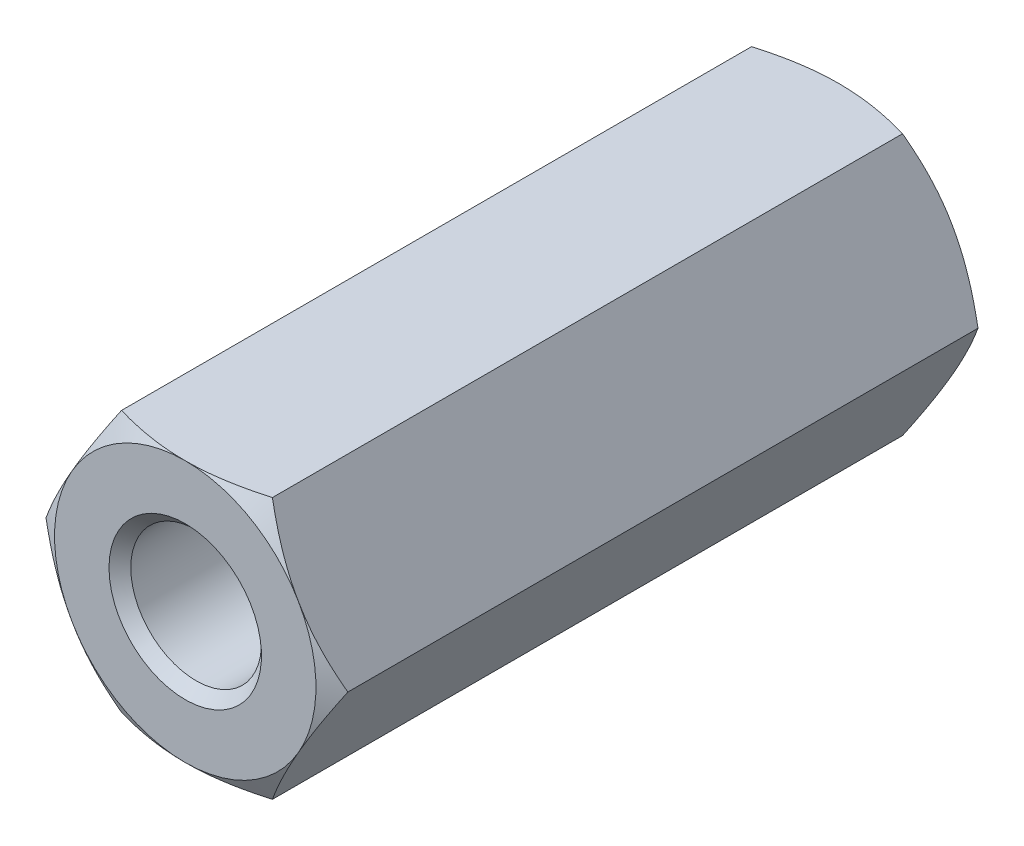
ISO-10303-21;
HEADER;
FILE_DESCRIPTION(('STEP AP214'),'2;1');
FILE_NAME('part.step','',(''),(''),'','','');
FILE_SCHEMA(('AUTOMOTIVE_DESIGN { 1 0 10303 214 1 1 1 1 }'));
ENDSEC;
DATA;
#1=APPLICATION_CONTEXT('core data for automotive mechanical design processes');
#2=APPLICATION_PROTOCOL_DEFINITION('international standard','automotive_design',2000,#1);
#3=PRODUCT_CONTEXT('',#1,'mechanical');
#4=PRODUCT('Part','Part','',(#3));
#5=PRODUCT_RELATED_PRODUCT_CATEGORY('part','',(#4));
#6=PRODUCT_DEFINITION_FORMATION('','',#4);
#7=PRODUCT_DEFINITION_CONTEXT('part definition',#1,'design');
#8=PRODUCT_DEFINITION('design','',#6,#7);
#9=PRODUCT_DEFINITION_SHAPE('','',#8);
#10=(LENGTH_UNIT() NAMED_UNIT(*) SI_UNIT(.MILLI.,.METRE.));
#11=(NAMED_UNIT(*) PLANE_ANGLE_UNIT() SI_UNIT($,.RADIAN.));
#12=(NAMED_UNIT(*) SI_UNIT($,.STERADIAN.) SOLID_ANGLE_UNIT());
#13=UNCERTAINTY_MEASURE_WITH_UNIT(LENGTH_MEASURE(1.E-05),#10,'distance_accuracy_value','');
#14=(GEOMETRIC_REPRESENTATION_CONTEXT(3) GLOBAL_UNCERTAINTY_ASSIGNED_CONTEXT((#13)) GLOBAL_UNIT_ASSIGNED_CONTEXT((#10,
#11,#12)) REPRESENTATION_CONTEXT('',''));
#15=CARTESIAN_POINT('',(0.,0.,0.));
#16=DIRECTION('',(0.,0.,1.));
#17=DIRECTION('',(1.,0.,0.));
#18=AXIS2_PLACEMENT_3D('',#15,#16,#17);
#19=CARTESIAN_POINT('',(3.46410161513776,0.,-7.5));
#20=DIRECTION('',(0.866025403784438,0.5,0.));
#21=DIRECTION('',(-0.5,0.866025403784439,0.));
#22=AXIS2_PLACEMENT_3D('',#19,#20,#21);
#23=PLANE('',#22);
#24=CARTESIAN_POINT('',(3.46421708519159,-0.000199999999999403,7.23198413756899));
#25=CARTESIAN_POINT('',(3.38810199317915,0.131635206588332,7.27594629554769));
#26=CARTESIAN_POINT('',(3.31132988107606,0.26460840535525,7.31592841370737));
#27=CARTESIAN_POINT('',(3.15645624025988,0.532857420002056,7.38571791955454));
#28=CARTESIAN_POINT('',(3.078351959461,0.668138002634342,7.41550061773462));
#29=CARTESIAN_POINT('',(2.92311136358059,0.937022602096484,7.46186216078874));
#30=CARTESIAN_POINT('',(2.84599893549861,1.07058524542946,7.47874955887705));
#31=CARTESIAN_POINT('',(2.6914112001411,1.33833905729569,7.49891035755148));
#32=CARTESIAN_POINT('',(2.61393645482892,1.47252925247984,7.50220045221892));
#33=CARTESIAN_POINT('',(2.46916798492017,1.72327559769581,7.49535946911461));
#34=CARTESIAN_POINT('',(2.40185259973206,1.83986926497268,7.48690808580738));
#35=CARTESIAN_POINT('',(2.2676603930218,2.07229698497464,7.46012105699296));
#36=CARTESIAN_POINT('',(2.2007840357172,2.18813023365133,7.44177625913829));
#37=CARTESIAN_POINT('',(2.06631510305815,2.42103725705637,7.39591524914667));
#38=CARTESIAN_POINT('',(1.99873954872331,2.53808155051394,7.36820461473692));
#39=CARTESIAN_POINT('',(1.86459637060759,2.77042435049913,7.3053122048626));
#40=CARTESIAN_POINT('',(1.79802702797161,2.88572583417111,7.27014520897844));
#41=CARTESIAN_POINT('',(1.73193533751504,3.0002,7.23198413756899));
#42=B_SPLINE_CURVE_WITH_KNOTS('',3,(#24,#25,#26,#27,#28,#29,#30,#31,#32,#33,#34,#35,#36,#37,#38,
#39,#40,#41),.UNSPECIFIED.,.F.,.F.,(4,2,2,2,2,2,2,2,4),(0.,0.475539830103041,0.952222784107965,
1.41710776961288,1.88142182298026,2.28572436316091,2.69040156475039,3.10405572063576,
3.5168974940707),.UNSPECIFIED.);
#43=CARTESIAN_POINT('',(3.46410161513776,0.,7.23205080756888));
#44=VERTEX_POINT('',#43);
#45=CARTESIAN_POINT('',(2.59807621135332,1.5,7.5));
#46=VERTEX_POINT('',#45);
#47=EDGE_CURVE('E127',#44,#46,#42,.T.);
#48=ORIENTED_EDGE('',*,*,#47,.F.);
#49=DIRECTION('',(0.,0.,1.));
#50=VECTOR('',#49,1.);
#51=CARTESIAN_POINT('',(3.46410161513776,0.,-7.5));
#52=LINE('',#51,#50);
#53=CARTESIAN_POINT('',(3.46410161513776,0.,-7.23205080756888));
#54=VERTEX_POINT('',#53);
#55=EDGE_CURVE('E564',#54,#44,#52,.T.);
#56=ORIENTED_EDGE('',*,*,#55,.F.);
#57=CARTESIAN_POINT('',(3.46421708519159,-0.000199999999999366,-7.23198413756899));
#58=CARTESIAN_POINT('',(3.38810199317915,0.131635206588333,-7.27594629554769));
#59=CARTESIAN_POINT('',(3.31132988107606,0.26460840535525,-7.31592841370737));
#60=CARTESIAN_POINT('',(3.15645624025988,0.532857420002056,-7.38571791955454));
#61=CARTESIAN_POINT('',(3.078351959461,0.668138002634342,-7.41550061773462));
#62=CARTESIAN_POINT('',(2.92311136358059,0.937022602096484,-7.46186216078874));
#63=CARTESIAN_POINT('',(2.84599893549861,1.07058524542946,-7.47874955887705));
#64=CARTESIAN_POINT('',(2.6914112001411,1.33833905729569,-7.49891035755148));
#65=CARTESIAN_POINT('',(2.61393645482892,1.47252925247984,-7.50220045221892));
#66=CARTESIAN_POINT('',(2.46916798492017,1.72327559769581,-7.49535946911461));
#67=CARTESIAN_POINT('',(2.40185259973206,1.83986926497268,-7.48690808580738));
#68=CARTESIAN_POINT('',(2.2676603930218,2.07229698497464,-7.46012105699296));
#69=CARTESIAN_POINT('',(2.2007840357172,2.18813023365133,-7.44177625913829));
#70=CARTESIAN_POINT('',(2.06631510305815,2.42103725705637,-7.39591524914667));
#71=CARTESIAN_POINT('',(1.99873954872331,2.53808155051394,-7.36820461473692));
#72=CARTESIAN_POINT('',(1.86459637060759,2.77042435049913,-7.3053122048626));
#73=CARTESIAN_POINT('',(1.79802702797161,2.88572583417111,-7.27014520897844));
#74=CARTESIAN_POINT('',(1.73193533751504,3.0002,-7.23198413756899));
#75=B_SPLINE_CURVE_WITH_KNOTS('',3,(#57,#58,#59,#60,#61,#62,#63,#64,#65,#66,#67,#68,#69,#70,#71,
#72,#73,#74),.UNSPECIFIED.,.F.,.F.,(4,2,2,2,2,2,2,2,4),(0.,0.475539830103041,0.952222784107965,
1.41710776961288,1.88142182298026,2.28572436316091,2.69040156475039,3.10405572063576,
3.5168974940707),.UNSPECIFIED.);
#76=CARTESIAN_POINT('',(2.59807621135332,1.5,-7.5));
#77=VERTEX_POINT('',#76);
#78=EDGE_CURVE('E534',#54,#77,#75,.T.);
#79=ORIENTED_EDGE('',*,*,#78,.T.);
#80=CARTESIAN_POINT('',(1.73205080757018,3.,-7.23205080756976));
#81=VERTEX_POINT('',#80);
#82=EDGE_CURVE('E269',#77,#81,#75,.T.);
#83=ORIENTED_EDGE('',*,*,#82,.T.);
#84=DIRECTION('',(0.,0.,1.));
#85=VECTOR('',#84,1.);
#86=CARTESIAN_POINT('',(1.73205080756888,3.,-7.5));
#87=LINE('',#86,#85);
#88=CARTESIAN_POINT('',(1.73205080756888,3.,7.23205080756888));
#89=VERTEX_POINT('',#88);
#90=EDGE_CURVE('E159',#81,#89,#87,.T.);
#91=ORIENTED_EDGE('',*,*,#90,.T.);
#92=EDGE_CURVE('E140',#46,#89,#42,.T.);
#93=ORIENTED_EDGE('',*,*,#92,.F.);
#94=EDGE_LOOP('',(#48,#56,#79,#83,#91,#93));
#95=FACE_BOUND('',#94,.T.);
#96=ADVANCED_FACE('F41',(#95),#23,.T.);
#97=CARTESIAN_POINT('',(1.73205080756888,-3.,-7.5));
#98=DIRECTION('',(0.866025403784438,-0.5,0.));
#99=DIRECTION('',(0.5,0.866025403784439,0.));
#100=AXIS2_PLACEMENT_3D('',#97,#98,#99);
#101=PLANE('',#100);
#102=CARTESIAN_POINT('',(1.73193533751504,-3.0002,7.23198413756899));
#103=CARTESIAN_POINT('',(1.80805042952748,-2.86836479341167,7.27594629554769));
#104=CARTESIAN_POINT('',(1.88482254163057,-2.73539159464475,7.31592841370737));
#105=CARTESIAN_POINT('',(2.03969618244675,-2.46714257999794,7.38571791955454));
#106=CARTESIAN_POINT('',(2.11780046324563,-2.33186199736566,7.41550061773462));
#107=CARTESIAN_POINT('',(2.27304105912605,-2.06297739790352,7.46186216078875));
#108=CARTESIAN_POINT('',(2.35015348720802,-1.92941475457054,7.47874955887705));
#109=CARTESIAN_POINT('',(2.50474122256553,-1.66166094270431,7.49891035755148));
#110=CARTESIAN_POINT('',(2.58221596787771,-1.52747074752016,7.50220045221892));
#111=CARTESIAN_POINT('',(2.72698443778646,-1.27672440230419,7.49535946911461));
#112=CARTESIAN_POINT('',(2.79429982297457,-1.16013073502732,7.48690808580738));
#113=CARTESIAN_POINT('',(2.92849202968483,-0.927703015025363,7.46012105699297));
#114=CARTESIAN_POINT('',(2.99536838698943,-0.811869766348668,7.44177625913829));
#115=CARTESIAN_POINT('',(3.12983731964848,-0.578962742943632,7.39591524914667));
#116=CARTESIAN_POINT('',(3.19741287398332,-0.461918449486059,7.36820461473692));
#117=CARTESIAN_POINT('',(3.33155605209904,-0.229575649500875,7.3053122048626));
#118=CARTESIAN_POINT('',(3.39812539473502,-0.114274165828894,7.27014520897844));
#119=CARTESIAN_POINT('',(3.46421708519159,0.000200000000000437,7.23198413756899));
#120=B_SPLINE_CURVE_WITH_KNOTS('',3,(#102,#103,#104,#105,#106,#107,#108,#109,#110,#111,#112,
#113,#114,#115,#116,#117,#118,#119),.UNSPECIFIED.,.F.,.F.,(4,2,2,2,2,2,2,2,4),(0.,
0.475539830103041,0.952222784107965,1.41710776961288,1.88142182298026,2.28572436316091,
2.69040156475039,3.10405572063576,3.5168974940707),.UNSPECIFIED.);
#121=CARTESIAN_POINT('',(1.73205080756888,-3.,7.23205080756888));
#122=VERTEX_POINT('',#121);
#123=CARTESIAN_POINT('',(2.59807621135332,-1.5,7.5));
#124=VERTEX_POINT('',#123);
#125=EDGE_CURVE('E539',#122,#124,#120,.T.);
#126=ORIENTED_EDGE('',*,*,#125,.F.);
#127=DIRECTION('',(0.,0.,1.));
#128=VECTOR('',#127,1.);
#129=CARTESIAN_POINT('',(1.73205080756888,-3.,-7.5));
#130=LINE('',#129,#128);
#131=CARTESIAN_POINT('',(1.73205080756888,-3.,-7.23205080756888));
#132=VERTEX_POINT('',#131);
#133=EDGE_CURVE('E283',#132,#122,#130,.T.);
#134=ORIENTED_EDGE('',*,*,#133,.F.);
#135=CARTESIAN_POINT('',(1.73193533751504,-3.0002,-7.23198413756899));
#136=CARTESIAN_POINT('',(1.80805042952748,-2.86836479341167,-7.27594629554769));
#137=CARTESIAN_POINT('',(1.88482254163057,-2.73539159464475,-7.31592841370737));
#138=CARTESIAN_POINT('',(2.03969618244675,-2.46714257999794,-7.38571791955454));
#139=CARTESIAN_POINT('',(2.11780046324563,-2.33186199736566,-7.41550061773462));
#140=CARTESIAN_POINT('',(2.27304105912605,-2.06297739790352,-7.46186216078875));
#141=CARTESIAN_POINT('',(2.35015348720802,-1.92941475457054,-7.47874955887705));
#142=CARTESIAN_POINT('',(2.50474122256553,-1.66166094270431,-7.49891035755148));
#143=CARTESIAN_POINT('',(2.58221596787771,-1.52747074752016,-7.50220045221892));
#144=CARTESIAN_POINT('',(2.72698443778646,-1.27672440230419,-7.49535946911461));
#145=CARTESIAN_POINT('',(2.79429982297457,-1.16013073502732,-7.48690808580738));
#146=CARTESIAN_POINT('',(2.92849202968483,-0.927703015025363,-7.46012105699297));
#147=CARTESIAN_POINT('',(2.99536838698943,-0.811869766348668,-7.44177625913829));
#148=CARTESIAN_POINT('',(3.12983731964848,-0.578962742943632,-7.39591524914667));
#149=CARTESIAN_POINT('',(3.19741287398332,-0.461918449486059,-7.36820461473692));
#150=CARTESIAN_POINT('',(3.33155605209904,-0.229575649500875,-7.3053122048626));
#151=CARTESIAN_POINT('',(3.39812539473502,-0.114274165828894,-7.27014520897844));
#152=CARTESIAN_POINT('',(3.46421708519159,0.000200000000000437,-7.23198413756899));
#153=B_SPLINE_CURVE_WITH_KNOTS('',3,(#135,#136,#137,#138,#139,#140,#141,#142,#143,#144,#145,
#146,#147,#148,#149,#150,#151,#152),.UNSPECIFIED.,.F.,.F.,(4,2,2,2,2,2,2,2,4),(0.,
0.475539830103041,0.952222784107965,1.41710776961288,1.88142182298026,2.28572436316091,
2.69040156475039,3.10405572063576,3.5168974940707),.UNSPECIFIED.);
#154=CARTESIAN_POINT('',(2.59807621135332,-1.5,-7.5));
#155=VERTEX_POINT('',#154);
#156=EDGE_CURVE('E545',#132,#155,#153,.T.);
#157=ORIENTED_EDGE('',*,*,#156,.T.);
#158=EDGE_CURVE('E284',#155,#54,#153,.T.);
#159=ORIENTED_EDGE('',*,*,#158,.T.);
#160=ORIENTED_EDGE('',*,*,#55,.T.);
#161=EDGE_CURVE('E132',#124,#44,#120,.T.);
#162=ORIENTED_EDGE('',*,*,#161,.F.);
#163=EDGE_LOOP('',(#126,#134,#157,#159,#160,#162));
#164=FACE_BOUND('',#163,.T.);
#165=ADVANCED_FACE('F254',(#164),#101,.T.);
#166=CARTESIAN_POINT('',(-1.73205080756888,-3.,-7.5));
#167=DIRECTION('',(0.,-1.,0.));
#168=DIRECTION('',(0.,0.,-1.));
#169=AXIS2_PLACEMENT_3D('',#166,#167,#168);
#170=PLANE('',#169);
#171=CARTESIAN_POINT('',(-13.3581553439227,-3.,1.32761504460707));
#172=CARTESIAN_POINT('',(-13.0674077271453,-3.,1.49139273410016));
#173=CARTESIAN_POINT('',(-12.7765550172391,-3.,1.65498426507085));
#174=CARTESIAN_POINT('',(-12.1945812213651,-3.,1.98169180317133));
#175=CARTESIAN_POINT('',(-11.9034601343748,-3.,2.14480780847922));
#176=CARTESIAN_POINT('',(-11.3208342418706,-3.,2.47049302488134));
#177=CARTESIAN_POINT('',(-11.0293293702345,-3.,2.63306211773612));
#178=CARTESIAN_POINT('',(-10.4459156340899,-3.,2.95747293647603));
#179=CARTESIAN_POINT('',(-10.1540067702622,-3.,3.11931466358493));
#180=CARTESIAN_POINT('',(-9.57133373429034,-3.,3.44115924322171));
#181=CARTESIAN_POINT('',(-9.28057244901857,-3.,3.60116731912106));
#182=CARTESIAN_POINT('',(-8.69840129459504,-3.,3.91999902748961));
#183=CARTESIAN_POINT('',(-8.40699142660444,-3.,4.0788226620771));
#184=CARTESIAN_POINT('',(-7.82335384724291,-3.,4.39488176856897));
#185=CARTESIAN_POINT('',(-7.53112623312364,-3.,4.55211741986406));
#186=CARTESIAN_POINT('',(-6.94553147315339,-3.,4.86445012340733));
#187=CARTESIAN_POINT('',(-6.65216433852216,-3.,5.01954719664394));
#188=CARTESIAN_POINT('',(-6.05641927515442,-3.,5.33061402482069));
#189=CARTESIAN_POINT('',(-5.75400103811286,-3.,5.48650672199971));
#190=CARTESIAN_POINT('',(-5.14673632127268,-3.,5.7936759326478));
#191=CARTESIAN_POINT('',(-4.84188938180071,-3.,5.94495154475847));
#192=CARTESIAN_POINT('',(-4.38096115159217,-3.,6.16688781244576));
#193=CARTESIAN_POINT('',(-4.22619248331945,-3.,6.24027062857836));
#194=CARTESIAN_POINT('',(-3.91555008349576,-3.,6.38465376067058));
#195=CARTESIAN_POINT('',(-3.75967638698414,-3.,6.45565415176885));
#196=CARTESIAN_POINT('',(-3.44659458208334,-3.,6.59456588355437));
#197=CARTESIAN_POINT('',(-3.28938678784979,-3.,6.66247792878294));
#198=CARTESIAN_POINT('',(-2.97329285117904,-3.,6.79425723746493));
#199=CARTESIAN_POINT('',(-2.81440685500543,-3.,6.85812485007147));
#200=CARTESIAN_POINT('',(-2.47241677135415,-3.,6.98897122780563));
#201=CARTESIAN_POINT('',(-2.28900492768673,-3.,7.05515675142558));
#202=CARTESIAN_POINT('',(-1.91889634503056,-3.,7.1778522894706));
#203=CARTESIAN_POINT('',(-1.73219914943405,-3.,7.23436094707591));
#204=CARTESIAN_POINT('',(-1.35757107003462,-3.,7.33330330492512));
#205=CARTESIAN_POINT('',(-1.16968774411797,-3.,7.3759103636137));
#206=CARTESIAN_POINT('',(-0.885576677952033,-3.,7.42686066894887));
#207=CARTESIAN_POINT('',(-0.790500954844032,-3.,7.44168327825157));
#208=CARTESIAN_POINT('',(-0.599732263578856,-3.,7.46654299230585));
#209=CARTESIAN_POINT('',(-0.504039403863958,-3.,7.47658091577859));
#210=CARTESIAN_POINT('',(-0.310465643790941,-3.,7.49164620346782));
#211=CARTESIAN_POINT('',(-0.212577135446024,-3.,7.49657696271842));
#212=CARTESIAN_POINT('',(-0.0166774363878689,-3.,7.50089527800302));
#213=CARTESIAN_POINT('',(0.0813337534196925,-3.,7.50028287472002));
#214=CARTESIAN_POINT('',(0.277172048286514,-3.,7.49353890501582));
#215=CARTESIAN_POINT('',(0.374999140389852,-3.,7.487406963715));
#216=CARTESIAN_POINT('',(0.570170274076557,-3.,7.46987533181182));
#217=CARTESIAN_POINT('',(0.667514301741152,-3.,7.45847549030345));
#218=CARTESIAN_POINT('',(0.960876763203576,-3.,7.41664053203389));
#219=CARTESIAN_POINT('',(1.15584956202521,-3.,7.37866756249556));
#220=CARTESIAN_POINT('',(1.44544526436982,-3.,7.31011549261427));
#221=CARTESIAN_POINT('',(1.54153346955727,-3.,7.28532185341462));
#222=CARTESIAN_POINT('',(1.73279599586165,-3.,7.23242137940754));
#223=CARTESIAN_POINT('',(1.8279703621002,-3.,7.20431470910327));
#224=CARTESIAN_POINT('',(2.08350367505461,-3.,7.12471346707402));
#225=CARTESIAN_POINT('',(2.24303639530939,-3.,7.07057745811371));
#226=CARTESIAN_POINT('',(2.55992784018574,-3.,6.95624024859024));
#227=CARTESIAN_POINT('',(2.71728599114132,-3.,6.89603748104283));
#228=CARTESIAN_POINT('',(3.03032027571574,-3.,6.77101720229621));
#229=CARTESIAN_POINT('',(3.18599466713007,-3.,6.70619535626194));
#230=CARTESIAN_POINT('',(3.49583273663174,-3.,6.57309454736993));
#231=CARTESIAN_POINT('',(3.64999655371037,-3.,6.50481590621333));
#232=CARTESIAN_POINT('',(3.95751153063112,-3.,6.36541468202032));
#233=CARTESIAN_POINT('',(4.11085953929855,-3.,6.29428517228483));
#234=CARTESIAN_POINT('',(4.41656841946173,-3.,6.14993195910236));
#235=CARTESIAN_POINT('',(4.5689292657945,-3.,6.07670820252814));
#236=CARTESIAN_POINT('',(5.02464616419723,-3.,5.85465847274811));
#237=CARTESIAN_POINT('',(5.32680431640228,-3.,5.70337673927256));
#238=CARTESIAN_POINT('',(5.93014146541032,-3.,5.39597031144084));
#239=CARTESIAN_POINT('',(6.23131182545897,-3.,5.23982878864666));
#240=CARTESIAN_POINT('',(6.83214794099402,-3.,4.92459449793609));
#241=CARTESIAN_POINT('',(7.13181350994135,-3.,4.76550137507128));
#242=CARTESIAN_POINT('',(7.72956256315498,-3.,4.44548367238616));
#243=CARTESIAN_POINT('',(8.02764778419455,-3.,4.28456232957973));
#244=CARTESIAN_POINT('',(8.62299007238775,-3.,3.96119400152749));
#245=CARTESIAN_POINT('',(8.92024713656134,-3.,3.79874701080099));
#246=CARTESIAN_POINT('',(9.56466312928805,-3.,3.4449615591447));
#247=CARTESIAN_POINT('',(9.91170551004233,-3.,3.25341096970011));
#248=CARTESIAN_POINT('',(10.6052826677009,-3.,2.86906995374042));
#249=CARTESIAN_POINT('',(10.9518171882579,-3.,2.67627906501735));
#250=CARTESIAN_POINT('',(11.6419356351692,-3.,2.29118510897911));
#251=CARTESIAN_POINT('',(11.9855230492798,-3.,2.09888828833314));
#252=CARTESIAN_POINT('',(12.6721730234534,-3.,1.71368353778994));
#253=CARTESIAN_POINT('',(13.0152357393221,-3.,1.52077588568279));
#254=CARTESIAN_POINT('',(13.3581553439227,-3.,1.32761504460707));
#255=B_SPLINE_CURVE_WITH_KNOTS('',3,(#171,#172,#173,#174,#175,#176,#177,#178,#179,#180,#181,
#182,#183,#184,#185,#186,#187,#188,#189,#190,#191,#192,#193,#194,#195,#196,#197,#198,#199,#200,
#201,#202,#203,#204,#205,#206,#207,#208,#209,#210,#211,#212,#213,#214,#215,#216,#217,#218,#219,
#220,#221,#222,#223,#224,#225,#226,#227,#228,#229,#230,#231,#232,#233,#234,#235,#236,#237,#238,
#239,#240,#241,#242,#243,#244,#245,#246,#247,#248,#249,#250,#251,#252,#253,#254),.UNSPECIFIED.,
.F.,.F.,(4,2,2,2,2,2,2,2,2,2,2,2,2,2,2,2,2,2,2,2,2,2,2,2,2,2,2,2,2,2,2,2,2,2,2,2,2,2,2,2,2,4),
(0.,1.00110750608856,2.00221884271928,3.00353425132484,4.00484797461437,5.00048761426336,
5.99612547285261,6.99164956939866,7.98716388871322,9.00784480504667,10.0287237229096,
10.5425621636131,11.0563843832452,11.5700887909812,12.0837487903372,12.6685158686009,
13.2533648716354,13.8306139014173,14.1191845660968,14.4077058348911,14.7015901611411,
14.9954723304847,15.289374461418,15.5832850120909,16.1782055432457,16.4758769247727,
16.773533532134,17.2787595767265,17.7841164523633,18.2899539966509,18.7957445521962,
19.3028489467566,19.8099662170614,20.8236468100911,21.8413478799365,22.8591721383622,
23.8754117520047,24.8916550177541,26.0808409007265,27.2704990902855,28.451715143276,
29.6324547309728),.UNSPECIFIED.);
#256=CARTESIAN_POINT('',(-1.73205080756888,-3.,7.23205080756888));
#257=VERTEX_POINT('',#256);
#258=CARTESIAN_POINT('',(0.,-3.,7.5));
#259=VERTEX_POINT('',#258);
#260=EDGE_CURVE('E537',#257,#259,#255,.T.);
#261=ORIENTED_EDGE('',*,*,#260,.F.);
#262=DIRECTION('',(0.,0.,1.));
#263=VECTOR('',#262,1.);
#264=CARTESIAN_POINT('',(-1.73205080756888,-3.,-7.5));
#265=LINE('',#264,#263);
#266=CARTESIAN_POINT('',(-1.73205080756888,-3.,-7.23205080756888));
#267=VERTEX_POINT('',#266);
#268=EDGE_CURVE('E558',#267,#257,#265,.T.);
#269=ORIENTED_EDGE('',*,*,#268,.F.);
#270=CARTESIAN_POINT('',(-8.64604011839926,-3.,-3.94830183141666));
#271=CARTESIAN_POINT('',(-8.45368531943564,-3.,-4.05321344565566));
#272=CARTESIAN_POINT('',(-8.26117828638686,-3.,-4.15784726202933));
#273=CARTESIAN_POINT('',(-7.87577965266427,-3.,-4.36641177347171));
#274=CARTESIAN_POINT('',(-7.68288804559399,-3.,-4.47034245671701));
#275=CARTESIAN_POINT('',(-7.29651600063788,-3.,-4.67741964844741));
#276=CARTESIAN_POINT('',(-7.10303525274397,-3.,-4.78056557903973));
#277=CARTESIAN_POINT('',(-6.7155110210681,-3.,-4.98579262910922));
#278=CARTESIAN_POINT('',(-6.52146754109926,-3.,-5.08787375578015));
#279=CARTESIAN_POINT('',(-6.12717231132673,-3.,-5.29356979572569));
#280=CARTESIAN_POINT('',(-5.92690044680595,-3.,-5.39714620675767));
#281=CARTESIAN_POINT('',(-5.52542127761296,-3.,-5.6024689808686));
#282=CARTESIAN_POINT('',(-5.32421398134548,-3.,-5.70421536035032));
#283=CARTESIAN_POINT('',(-4.92065250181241,-3.,-5.90527006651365));
#284=CARTESIAN_POINT('',(-4.71829865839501,-3.,-6.00457907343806));
#285=CARTESIAN_POINT('',(-4.31203204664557,-3.,-6.19994660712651));
#286=CARTESIAN_POINT('',(-4.10811934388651,-3.,-6.29600526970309));
#287=CARTESIAN_POINT('',(-3.69104144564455,-3.,-6.4869319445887));
#288=CARTESIAN_POINT('',(-3.47780257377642,-3.,-6.58164003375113));
#289=CARTESIAN_POINT('',(-3.04830169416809,-3.,-6.76419244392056));
#290=CARTESIAN_POINT('',(-2.83203885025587,-3.,-6.85203482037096));
#291=CARTESIAN_POINT('',(-2.39712563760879,-3.,-7.0169911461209));
#292=CARTESIAN_POINT('',(-2.17850236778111,-3.,-7.09417551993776));
#293=CARTESIAN_POINT('',(-1.73648860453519,-3.,-7.23361718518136));
#294=CARTESIAN_POINT('',(-1.51310048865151,-3.,-7.295881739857));
#295=CARTESIAN_POINT('',(-1.12382631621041,-3.,-7.38448212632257));
#296=CARTESIAN_POINT('',(-0.959139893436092,-3.,-7.41599244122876));
#297=CARTESIAN_POINT('',(-0.627685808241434,-3.,-7.46490689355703));
#298=CARTESIAN_POINT('',(-0.460919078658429,-3.,-7.48231713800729));
#299=CARTESIAN_POINT('',(-0.126992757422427,-3.,-7.50109298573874));
#300=CARTESIAN_POINT('',(0.0401638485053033,-3.,-7.50250998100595));
#301=CARTESIAN_POINT('',(0.373853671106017,-3.,-7.48925282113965));
#302=CARTESIAN_POINT('',(0.540386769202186,-3.,-7.47457574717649));
#303=CARTESIAN_POINT('',(0.824129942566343,-3.,-7.43706932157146));
#304=CARTESIAN_POINT('',(0.941831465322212,-3.,-7.41776959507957));
#305=CARTESIAN_POINT('',(1.17601843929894,-3.,-7.37276480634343));
#306=CARTESIAN_POINT('',(1.29250365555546,-3.,-7.34705852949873));
#307=CARTESIAN_POINT('',(1.52424748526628,-3.,-7.29020422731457));
#308=CARTESIAN_POINT('',(1.63950471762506,-3.,-7.25905064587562));
#309=CARTESIAN_POINT('',(1.86869640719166,-3.,-7.19225995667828));
#310=CARTESIAN_POINT('',(1.9826309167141,-3.,-7.15662302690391));
#311=CARTESIAN_POINT('',(2.21128623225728,-3.,-7.08101678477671));
#312=CARTESIAN_POINT('',(2.32598521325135,-3.,-7.04098190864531));
#313=CARTESIAN_POINT('',(2.55425959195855,-3.,-6.9578168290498));
#314=CARTESIAN_POINT('',(2.66783489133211,-3.,-6.91468635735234));
#315=CARTESIAN_POINT('',(3.00693599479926,-3.,-6.78160571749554));
#316=CARTESIAN_POINT('',(3.23099087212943,-3.,-6.68791365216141));
#317=CARTESIAN_POINT('',(3.68279803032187,-3.,-6.49097387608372));
#318=CARTESIAN_POINT('',(3.91046100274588,-3.,-6.38752439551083));
#319=CARTESIAN_POINT('',(4.36352762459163,-3.,-6.17576123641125));
#320=CARTESIAN_POINT('',(4.58893106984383,-3.,-6.06744712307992));
#321=CARTESIAN_POINT('',(5.03816268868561,-3.,-5.84733049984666));
#322=CARTESIAN_POINT('',(5.26198999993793,-3.,-5.73552623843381));
#323=CARTESIAN_POINT('',(5.70837689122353,-3.,-5.50941222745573));
#324=CARTESIAN_POINT('',(5.93093645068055,-3.,-5.39510243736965));
#325=CARTESIAN_POINT('',(6.36219153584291,-3.,-5.17129989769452));
#326=CARTESIAN_POINT('',(6.57094194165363,-3.,-5.06191268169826));
#327=CARTESIAN_POINT('',(6.98776257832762,-3.,-4.8418449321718));
#328=CARTESIAN_POINT('',(7.19583280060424,-3.,-4.7311643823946));
#329=CARTESIAN_POINT('',(7.61118044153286,-3.,-4.50891711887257));
#330=CARTESIAN_POINT('',(7.81845850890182,-3.,-4.39735161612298));
#331=CARTESIAN_POINT('',(8.23256258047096,-3.,-4.17339738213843));
#332=CARTESIAN_POINT('',(8.439388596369,-3.,-4.06100867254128));
#333=CARTESIAN_POINT('',(8.64604011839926,-3.,-3.94830183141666));
#334=B_SPLINE_CURVE_WITH_KNOTS('',3,(#270,#271,#272,#273,#274,#275,#276,#277,#278,#279,#280,
#281,#282,#283,#284,#285,#286,#287,#288,#289,#290,#291,#292,#293,#294,#295,#296,#297,#298,#299,
#300,#301,#302,#303,#304,#305,#306,#307,#308,#309,#310,#311,#312,#313,#314,#315,#316,#317,#318,
#319,#320,#321,#322,#323,#324,#325,#326,#327,#328,#329,#330,#331,#332,#333),.UNSPECIFIED.,.F.,
.F.,(4,2,2,2,2,2,2,2,2,2,2,2,2,2,2,2,2,2,2,2,2,2,2,2,2,2,2,2,2,2,2,4),(0.,0.657314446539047,
1.31463991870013,1.97240995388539,2.63017554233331,3.30657953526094,3.9829774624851,
4.65918441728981,5.33536308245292,6.03525738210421,6.73534919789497,7.43056764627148,
8.12544695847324,8.62797738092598,9.13029003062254,9.63098811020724,10.1317770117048,
10.4894145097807,10.8471198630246,11.2051922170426,11.5632503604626,11.9276514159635,
12.2920840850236,13.020462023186,13.7705849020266,14.5207749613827,15.2713477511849,
16.0219326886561,16.7289495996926,17.4359754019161,18.1421600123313,18.8483261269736),.UNSPECIFIED.);
#335=CARTESIAN_POINT('',(0.,-3.,-7.5));
#336=VERTEX_POINT('',#335);
#337=EDGE_CURVE('E566',#267,#336,#334,.T.);
#338=ORIENTED_EDGE('',*,*,#337,.T.);
#339=EDGE_CURVE('E259',#336,#132,#334,.T.);
#340=ORIENTED_EDGE('',*,*,#339,.T.);
#341=ORIENTED_EDGE('',*,*,#133,.T.);
#342=EDGE_CURVE('E138',#259,#122,#255,.T.);
#343=ORIENTED_EDGE('',*,*,#342,.F.);
#344=EDGE_LOOP('',(#261,#269,#338,#340,#341,#343));
#345=FACE_BOUND('',#344,.T.);
#346=ADVANCED_FACE('F292',(#345),#170,.T.);
#347=CARTESIAN_POINT('',(-3.46410161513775,0.,-7.5));
#348=DIRECTION('',(-0.866025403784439,-0.5,0.));
#349=DIRECTION('',(0.5,-0.866025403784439,0.));
#350=AXIS2_PLACEMENT_3D('',#347,#348,#349);
#351=PLANE('',#350);
#352=CARTESIAN_POINT('',(-3.46421708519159,0.000200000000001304,7.23198413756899));
#353=CARTESIAN_POINT('',(-3.38810199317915,-0.131635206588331,7.27594629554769));
#354=CARTESIAN_POINT('',(-3.31132988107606,-0.264608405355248,7.31592841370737));
#355=CARTESIAN_POINT('',(-3.15645624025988,-0.532857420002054,7.38571791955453));
#356=CARTESIAN_POINT('',(-3.078351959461,-0.66813800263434,7.41550061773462));
#357=CARTESIAN_POINT('',(-2.92311136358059,-0.937022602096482,7.46186216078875));
#358=CARTESIAN_POINT('',(-2.84599893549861,-1.07058524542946,7.47874955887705));
#359=CARTESIAN_POINT('',(-2.6914112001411,-1.33833905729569,7.49891035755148));
#360=CARTESIAN_POINT('',(-2.61393645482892,-1.47252925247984,7.50220045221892));
#361=CARTESIAN_POINT('',(-2.46916798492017,-1.72327559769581,7.49535946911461));
#362=CARTESIAN_POINT('',(-2.40185259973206,-1.83986926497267,7.48690808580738));
#363=CARTESIAN_POINT('',(-2.2676603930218,-2.07229698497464,7.46012105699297));
#364=CARTESIAN_POINT('',(-2.2007840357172,-2.18813023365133,7.44177625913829));
#365=CARTESIAN_POINT('',(-2.06631510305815,-2.42103725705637,7.39591524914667));
#366=CARTESIAN_POINT('',(-1.99873954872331,-2.53808155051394,7.36820461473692));
#367=CARTESIAN_POINT('',(-1.86459637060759,-2.77042435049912,7.3053122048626));
#368=CARTESIAN_POINT('',(-1.79802702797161,-2.88572583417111,7.27014520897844));
#369=CARTESIAN_POINT('',(-1.73193533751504,-3.0002,7.23198413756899));
#370=B_SPLINE_CURVE_WITH_KNOTS('',3,(#352,#353,#354,#355,#356,#357,#358,#359,#360,#361,#362,
#363,#364,#365,#366,#367,#368,#369),.UNSPECIFIED.,.F.,.F.,(4,2,2,2,2,2,2,2,4),(0.,
0.47553983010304,0.952222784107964,1.41710776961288,1.88142182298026,2.28572436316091,
2.69040156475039,3.10405572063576,3.5168974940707),.UNSPECIFIED.);
#371=CARTESIAN_POINT('',(-3.46410161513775,0.,7.23205080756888));
#372=VERTEX_POINT('',#371);
#373=CARTESIAN_POINT('',(-2.59807621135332,-1.5,7.5));
#374=VERTEX_POINT('',#373);
#375=EDGE_CURVE('E176',#372,#374,#370,.T.);
#376=ORIENTED_EDGE('',*,*,#375,.F.);
#377=DIRECTION('',(0.,0.,1.));
#378=VECTOR('',#377,1.);
#379=CARTESIAN_POINT('',(-3.46410161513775,0.,-7.5));
#380=LINE('',#379,#378);
#381=CARTESIAN_POINT('',(-3.46410161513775,0.,-7.23205080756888));
#382=VERTEX_POINT('',#381);
#383=EDGE_CURVE('E553',#382,#372,#380,.T.);
#384=ORIENTED_EDGE('',*,*,#383,.F.);
#385=CARTESIAN_POINT('',(-3.46421708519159,0.000200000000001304,-7.23198413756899));
#386=CARTESIAN_POINT('',(-3.38810199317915,-0.131635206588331,-7.27594629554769));
#387=CARTESIAN_POINT('',(-3.31132988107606,-0.264608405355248,-7.31592841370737));
#388=CARTESIAN_POINT('',(-3.15645624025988,-0.532857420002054,-7.38571791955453));
#389=CARTESIAN_POINT('',(-3.078351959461,-0.66813800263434,-7.41550061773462));
#390=CARTESIAN_POINT('',(-2.92311136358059,-0.937022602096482,-7.46186216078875));
#391=CARTESIAN_POINT('',(-2.84599893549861,-1.07058524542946,-7.47874955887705));
#392=CARTESIAN_POINT('',(-2.6914112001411,-1.33833905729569,-7.49891035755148));
#393=CARTESIAN_POINT('',(-2.61393645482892,-1.47252925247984,-7.50220045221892));
#394=CARTESIAN_POINT('',(-2.46916798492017,-1.72327559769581,-7.49535946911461));
#395=CARTESIAN_POINT('',(-2.40185259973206,-1.83986926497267,-7.48690808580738));
#396=CARTESIAN_POINT('',(-2.2676603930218,-2.07229698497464,-7.46012105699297));
#397=CARTESIAN_POINT('',(-2.2007840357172,-2.18813023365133,-7.44177625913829));
#398=CARTESIAN_POINT('',(-2.06631510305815,-2.42103725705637,-7.39591524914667));
#399=CARTESIAN_POINT('',(-1.99873954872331,-2.53808155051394,-7.36820461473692));
#400=CARTESIAN_POINT('',(-1.86459637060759,-2.77042435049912,-7.3053122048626));
#401=CARTESIAN_POINT('',(-1.79802702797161,-2.88572583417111,-7.27014520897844));
#402=CARTESIAN_POINT('',(-1.73193533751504,-3.0002,-7.23198413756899));
#403=B_SPLINE_CURVE_WITH_KNOTS('',3,(#385,#386,#387,#388,#389,#390,#391,#392,#393,#394,#395,
#396,#397,#398,#399,#400,#401,#402),.UNSPECIFIED.,.F.,.F.,(4,2,2,2,2,2,2,2,4),(0.,
0.47553983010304,0.952222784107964,1.41710776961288,1.88142182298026,2.28572436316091,
2.69040156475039,3.10405572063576,3.5168974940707),.UNSPECIFIED.);
#404=CARTESIAN_POINT('',(-2.59807621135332,-1.5,-7.5));
#405=VERTEX_POINT('',#404);
#406=EDGE_CURVE('E275',#382,#405,#403,.T.);
#407=ORIENTED_EDGE('',*,*,#406,.T.);
#408=EDGE_CURVE('E282',#405,#267,#403,.T.);
#409=ORIENTED_EDGE('',*,*,#408,.T.);
#410=ORIENTED_EDGE('',*,*,#268,.T.);
#411=EDGE_CURVE('E527',#374,#257,#370,.T.);
#412=ORIENTED_EDGE('',*,*,#411,.F.);
#413=EDGE_LOOP('',(#376,#384,#407,#409,#410,#412));
#414=FACE_BOUND('',#413,.T.);
#415=ADVANCED_FACE('F289',(#414),#351,.T.);
#416=CARTESIAN_POINT('',(-1.73205080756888,3.,-7.5));
#417=DIRECTION('',(-0.866025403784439,0.5,0.));
#418=DIRECTION('',(-0.5,-0.866025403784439,0.));
#419=AXIS2_PLACEMENT_3D('',#416,#417,#418);
#420=PLANE('',#419);
#421=CARTESIAN_POINT('',(-1.73193533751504,3.0002,7.23198413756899));
#422=CARTESIAN_POINT('',(-1.80805042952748,2.86836479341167,7.27594629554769));
#423=CARTESIAN_POINT('',(-1.88482254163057,2.73539159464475,7.31592841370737));
#424=CARTESIAN_POINT('',(-2.03969618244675,2.46714257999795,7.38571791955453));
#425=CARTESIAN_POINT('',(-2.11780046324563,2.33186199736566,7.41550061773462));
#426=CARTESIAN_POINT('',(-2.27304105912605,2.06297739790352,7.46186216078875));
#427=CARTESIAN_POINT('',(-2.35015348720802,1.92941475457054,7.47874955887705));
#428=CARTESIAN_POINT('',(-2.50474122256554,1.66166094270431,7.49891035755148));
#429=CARTESIAN_POINT('',(-2.58221596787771,1.52747074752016,7.50220045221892));
#430=CARTESIAN_POINT('',(-2.72698443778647,1.27672440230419,7.49535946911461));
#431=CARTESIAN_POINT('',(-2.79429982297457,1.16013073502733,7.48690808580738));
#432=CARTESIAN_POINT('',(-2.92849202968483,0.927703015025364,7.46012105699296));
#433=CARTESIAN_POINT('',(-2.99536838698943,0.81186976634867,7.44177625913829));
#434=CARTESIAN_POINT('',(-3.12983731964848,0.578962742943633,7.39591524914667));
#435=CARTESIAN_POINT('',(-3.19741287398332,0.46191844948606,7.36820461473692));
#436=CARTESIAN_POINT('',(-3.33155605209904,0.229575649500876,7.3053122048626));
#437=CARTESIAN_POINT('',(-3.39812539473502,0.114274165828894,7.27014520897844));
#438=CARTESIAN_POINT('',(-3.46421708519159,-0.000199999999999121,7.23198413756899));
#439=B_SPLINE_CURVE_WITH_KNOTS('',3,(#421,#422,#423,#424,#425,#426,#427,#428,#429,#430,#431,
#432,#433,#434,#435,#436,#437,#438),.UNSPECIFIED.,.F.,.F.,(4,2,2,2,2,2,2,2,4),(0.,
0.475539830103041,0.952222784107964,1.41710776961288,1.88142182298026,2.28572436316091,
2.69040156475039,3.10405572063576,3.5168974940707),.UNSPECIFIED.);
#440=CARTESIAN_POINT('',(-1.73205080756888,3.,7.23205080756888));
#441=VERTEX_POINT('',#440);
#442=CARTESIAN_POINT('',(-2.59807621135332,1.5,7.5));
#443=VERTEX_POINT('',#442);
#444=EDGE_CURVE('E183',#441,#443,#439,.T.);
#445=ORIENTED_EDGE('',*,*,#444,.F.);
#446=DIRECTION('',(0.,0.,1.));
#447=VECTOR('',#446,1.);
#448=CARTESIAN_POINT('',(-1.73205080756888,3.,-7.5));
#449=LINE('',#448,#447);
#450=CARTESIAN_POINT('',(-1.73205080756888,3.,-7.23205080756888));
#451=VERTEX_POINT('',#450);
#452=EDGE_CURVE('E233',#451,#441,#449,.T.);
#453=ORIENTED_EDGE('',*,*,#452,.F.);
#454=CARTESIAN_POINT('',(-1.73193533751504,3.0002,-7.23198413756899));
#455=CARTESIAN_POINT('',(-1.80805042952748,2.86836479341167,-7.27594629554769));
#456=CARTESIAN_POINT('',(-1.88482254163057,2.73539159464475,-7.31592841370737));
#457=CARTESIAN_POINT('',(-2.03969618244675,2.46714257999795,-7.38571791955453));
#458=CARTESIAN_POINT('',(-2.11780046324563,2.33186199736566,-7.41550061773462));
#459=CARTESIAN_POINT('',(-2.27304105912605,2.06297739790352,-7.46186216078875));
#460=CARTESIAN_POINT('',(-2.35015348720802,1.92941475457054,-7.47874955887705));
#461=CARTESIAN_POINT('',(-2.50474122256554,1.66166094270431,-7.49891035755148));
#462=CARTESIAN_POINT('',(-2.58221596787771,1.52747074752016,-7.50220045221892));
#463=CARTESIAN_POINT('',(-2.72698443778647,1.27672440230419,-7.49535946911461));
#464=CARTESIAN_POINT('',(-2.79429982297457,1.16013073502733,-7.48690808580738));
#465=CARTESIAN_POINT('',(-2.92849202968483,0.927703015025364,-7.46012105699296));
#466=CARTESIAN_POINT('',(-2.99536838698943,0.81186976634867,-7.44177625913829));
#467=CARTESIAN_POINT('',(-3.12983731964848,0.578962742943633,-7.39591524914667));
#468=CARTESIAN_POINT('',(-3.19741287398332,0.46191844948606,-7.36820461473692));
#469=CARTESIAN_POINT('',(-3.33155605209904,0.229575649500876,-7.3053122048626));
#470=CARTESIAN_POINT('',(-3.39812539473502,0.114274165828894,-7.27014520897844));
#471=CARTESIAN_POINT('',(-3.46421708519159,-0.000199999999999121,-7.23198413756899));
#472=B_SPLINE_CURVE_WITH_KNOTS('',3,(#454,#455,#456,#457,#458,#459,#460,#461,#462,#463,#464,
#465,#466,#467,#468,#469,#470,#471),.UNSPECIFIED.,.F.,.F.,(4,2,2,2,2,2,2,2,4),(0.,
0.475539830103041,0.952222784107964,1.41710776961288,1.88142182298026,2.28572436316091,
2.69040156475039,3.10405572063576,3.5168974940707),.UNSPECIFIED.);
#473=CARTESIAN_POINT('',(-2.59807621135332,1.5,-7.5));
#474=VERTEX_POINT('',#473);
#475=EDGE_CURVE('E237',#451,#474,#472,.T.);
#476=ORIENTED_EDGE('',*,*,#475,.T.);
#477=EDGE_CURVE('E557',#474,#382,#472,.T.);
#478=ORIENTED_EDGE('',*,*,#477,.T.);
#479=ORIENTED_EDGE('',*,*,#383,.T.);
#480=EDGE_CURVE('E603',#443,#372,#439,.T.);
#481=ORIENTED_EDGE('',*,*,#480,.F.);
#482=EDGE_LOOP('',(#445,#453,#476,#478,#479,#481));
#483=FACE_BOUND('',#482,.T.);
#484=ADVANCED_FACE('F218',(#483),#420,.T.);
#485=CARTESIAN_POINT('',(1.73205080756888,3.,-7.5));
#486=DIRECTION('',(0.,1.,0.));
#487=DIRECTION('',(-1.,0.,0.));
#488=AXIS2_PLACEMENT_3D('',#485,#486,#487);
#489=PLANE('',#488);
#490=CARTESIAN_POINT('',(13.3581553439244,3.,1.32761504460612));
#491=CARTESIAN_POINT('',(13.0674077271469,3.,1.49139273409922));
#492=CARTESIAN_POINT('',(12.7765550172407,3.,1.65498426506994));
#493=CARTESIAN_POINT('',(12.1945812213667,3.,1.98169180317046));
#494=CARTESIAN_POINT('',(11.9034601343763,3.,2.14480780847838));
#495=CARTESIAN_POINT('',(11.320834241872,3.,2.47049302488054));
#496=CARTESIAN_POINT('',(11.0293293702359,3.,2.63306211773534));
#497=CARTESIAN_POINT('',(10.4459156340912,3.,2.95747293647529));
#498=CARTESIAN_POINT('',(10.1540067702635,3.,3.11931466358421));
#499=CARTESIAN_POINT('',(9.57133373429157,3.,3.44115924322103));
#500=CARTESIAN_POINT('',(9.28057244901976,3.,3.60116731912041));
#501=CARTESIAN_POINT('',(8.69840129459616,3.,3.919999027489));
#502=CARTESIAN_POINT('',(8.40699142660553,3.,4.0788226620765));
#503=CARTESIAN_POINT('',(7.82335384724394,3.,4.39488176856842));
#504=CARTESIAN_POINT('',(7.53112623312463,3.,4.55211741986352));
#505=CARTESIAN_POINT('',(6.94553147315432,3.,4.86445012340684));
#506=CARTESIAN_POINT('',(6.65216433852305,3.,5.01954719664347));
#507=CARTESIAN_POINT('',(6.05641927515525,3.,5.33061402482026));
#508=CARTESIAN_POINT('',(5.75400103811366,3.,5.48650672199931));
#509=CARTESIAN_POINT('',(5.14673632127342,3.,5.79367593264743));
#510=CARTESIAN_POINT('',(4.84188938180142,3.,5.94495154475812));
#511=CARTESIAN_POINT('',(4.38096115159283,3.,6.16688781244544));
#512=CARTESIAN_POINT('',(4.22619248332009,3.,6.24027062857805));
#513=CARTESIAN_POINT('',(3.91555008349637,3.,6.3846537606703));
#514=CARTESIAN_POINT('',(3.75967638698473,3.,6.45565415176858));
#515=CARTESIAN_POINT('',(3.4465945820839,3.,6.59456588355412));
#516=CARTESIAN_POINT('',(3.28938678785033,3.,6.6624779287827));
#517=CARTESIAN_POINT('',(2.97329285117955,3.,6.79425723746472));
#518=CARTESIAN_POINT('',(2.81440685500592,3.,6.85812485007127));
#519=CARTESIAN_POINT('',(2.47241677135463,3.,6.98897122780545));
#520=CARTESIAN_POINT('',(2.28900492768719,3.,7.05515675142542));
#521=CARTESIAN_POINT('',(1.918896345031,3.,7.17785228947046));
#522=CARTESIAN_POINT('',(1.73219914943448,3.,7.23436094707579));
#523=CARTESIAN_POINT('',(1.35757107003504,3.,7.33330330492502));
#524=CARTESIAN_POINT('',(1.16968774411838,3.,7.37591036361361));
#525=CARTESIAN_POINT('',(0.885576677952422,3.,7.42686066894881));
#526=CARTESIAN_POINT('',(0.790500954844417,3.,7.44168327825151));
#527=CARTESIAN_POINT('',(0.59973226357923,3.,7.46654299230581));
#528=CARTESIAN_POINT('',(0.504039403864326,3.,7.47658091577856));
#529=CARTESIAN_POINT('',(0.310465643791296,3.,7.4916462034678));
#530=CARTESIAN_POINT('',(0.212577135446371,3.,7.4965769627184));
#531=CARTESIAN_POINT('',(0.0166774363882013,3.,7.50089527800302));
#532=CARTESIAN_POINT('',(-0.0813337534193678,3.,7.50028287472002));
#533=CARTESIAN_POINT('',(-0.277172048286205,3.,7.49353890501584));
#534=CARTESIAN_POINT('',(-0.374999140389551,3.,7.48740696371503));
#535=CARTESIAN_POINT('',(-0.570170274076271,3.,7.46987533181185));
#536=CARTESIAN_POINT('',(-0.667514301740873,3.,7.45847549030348));
#537=CARTESIAN_POINT('',(-0.96087676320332,3.,7.41664053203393));
#538=CARTESIAN_POINT('',(-1.15584956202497,3.,7.3786675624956));
#539=CARTESIAN_POINT('',(-1.44544526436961,3.,7.31011549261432));
#540=CARTESIAN_POINT('',(-1.54153346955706,3.,7.28532185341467));
#541=CARTESIAN_POINT('',(-1.73279599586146,3.,7.2324213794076));
#542=CARTESIAN_POINT('',(-1.82797036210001,3.,7.20431470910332));
#543=CARTESIAN_POINT('',(-2.08350367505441,3.,7.12471346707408));
#544=CARTESIAN_POINT('',(-2.24303639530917,3.,7.07057745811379));
#545=CARTESIAN_POINT('',(-2.55992784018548,3.,6.95624024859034));
#546=CARTESIAN_POINT('',(-2.71728599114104,3.,6.89603748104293));
#547=CARTESIAN_POINT('',(-3.03032027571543,3.,6.77101720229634));
#548=CARTESIAN_POINT('',(-3.18599466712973,3.,6.70619535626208));
#549=CARTESIAN_POINT('',(-3.49583273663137,3.,6.57309454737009));
#550=CARTESIAN_POINT('',(-3.64999655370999,3.,6.5048159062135));
#551=CARTESIAN_POINT('',(-3.9575115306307,3.,6.36541468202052));
#552=CARTESIAN_POINT('',(-4.1108595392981,3.,6.29428517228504));
#553=CARTESIAN_POINT('',(-4.41656841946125,3.,6.14993195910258));
#554=CARTESIAN_POINT('',(-4.56892926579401,3.,6.07670820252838));
#555=CARTESIAN_POINT('',(-5.02464616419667,3.,5.85465847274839));
#556=CARTESIAN_POINT('',(-5.32680431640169,3.,5.70337673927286));
#557=CARTESIAN_POINT('',(-5.93014146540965,3.,5.39597031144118));
#558=CARTESIAN_POINT('',(-6.23131182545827,3.,5.23982878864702));
#559=CARTESIAN_POINT('',(-6.83214794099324,3.,4.9245944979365));
#560=CARTESIAN_POINT('',(-7.13181350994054,3.,4.76550137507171));
#561=CARTESIAN_POINT('',(-7.72956256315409,3.,4.44548367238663));
#562=CARTESIAN_POINT('',(-8.02764778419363,3.,4.28456232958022));
#563=CARTESIAN_POINT('',(-8.62299007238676,3.,3.96119400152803));
#564=CARTESIAN_POINT('',(-8.92024713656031,3.,3.79874701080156));
#565=CARTESIAN_POINT('',(-9.56466312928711,3.,3.44496155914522));
#566=CARTESIAN_POINT('',(-9.91170551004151,3.,3.25341096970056));
#567=CARTESIAN_POINT('',(-10.6052826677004,3.,2.86906995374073));
#568=CARTESIAN_POINT('',(-10.9518171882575,3.,2.6762790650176));
#569=CARTESIAN_POINT('',(-11.641935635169,3.,2.29118510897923));
#570=CARTESIAN_POINT('',(-11.9855230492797,3.,2.09888828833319));
#571=CARTESIAN_POINT('',(-12.6721730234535,3.,1.71368353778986));
#572=CARTESIAN_POINT('',(-13.0152357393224,3.,1.52077588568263));
#573=CARTESIAN_POINT('',(-13.3581553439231,3.,1.32761504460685));
#574=B_SPLINE_CURVE_WITH_KNOTS('',3,(#490,#491,#492,#493,#494,#495,#496,#497,#498,#499,#500,
#501,#502,#503,#504,#505,#506,#507,#508,#509,#510,#511,#512,#513,#514,#515,#516,#517,#518,#519,
#520,#521,#522,#523,#524,#525,#526,#527,#528,#529,#530,#531,#532,#533,#534,#535,#536,#537,#538,
#539,#540,#541,#542,#543,#544,#545,#546,#547,#548,#549,#550,#551,#552,#553,#554,#555,#556,#557,
#558,#559,#560,#561,#562,#563,#564,#565,#566,#567,#568,#569,#570,#571,#572,#573),.UNSPECIFIED.,
.F.,.F.,(4,2,2,2,2,2,2,2,2,2,2,2,2,2,2,2,2,2,2,2,2,2,2,2,2,2,2,2,2,2,2,2,2,2,2,2,2,2,2,2,2,4),
(0.,1.00110750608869,2.00221884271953,3.00353425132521,4.00484797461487,5.00048761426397,
5.99612547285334,6.99164956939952,7.98716388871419,9.00784480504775,10.0287237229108,
10.5425621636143,11.0563843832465,11.5700887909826,12.0837487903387,12.6685158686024,
13.2533648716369,13.8306139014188,14.1191845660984,14.4077058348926,14.7015901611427,
14.9954723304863,15.2893744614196,15.5832850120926,16.1782055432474,16.4758769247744,
16.7735335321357,17.2787595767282,17.7841164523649,18.2899539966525,18.7957445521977,
19.302848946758,19.8099662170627,20.8236468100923,21.8413478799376,22.8591721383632,
23.8754117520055,24.8916550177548,26.0808409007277,27.270499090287,28.451715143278,
29.6324547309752),.UNSPECIFIED.);
#575=CARTESIAN_POINT('',(0.,3.,7.5));
#576=VERTEX_POINT('',#575);
#577=EDGE_CURVE('E145',#89,#576,#574,.T.);
#578=ORIENTED_EDGE('',*,*,#577,.F.);
#579=ORIENTED_EDGE('',*,*,#90,.F.);
#580=CARTESIAN_POINT('',(8.64604011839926,3.,-3.94830183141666));
#581=CARTESIAN_POINT('',(8.45368531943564,3.,-4.05321344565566));
#582=CARTESIAN_POINT('',(8.26117828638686,3.,-4.15784726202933));
#583=CARTESIAN_POINT('',(7.87577965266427,3.,-4.36641177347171));
#584=CARTESIAN_POINT('',(7.68288804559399,3.,-4.470342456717));
#585=CARTESIAN_POINT('',(7.29651600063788,3.,-4.67741964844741));
#586=CARTESIAN_POINT('',(7.10303525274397,3.,-4.78056557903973));
#587=CARTESIAN_POINT('',(6.7155110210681,3.,-4.98579262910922));
#588=CARTESIAN_POINT('',(6.52146754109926,3.,-5.08787375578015));
#589=CARTESIAN_POINT('',(6.12717231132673,3.,-5.29356979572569));
#590=CARTESIAN_POINT('',(5.92690044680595,3.,-5.39714620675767));
#591=CARTESIAN_POINT('',(5.52542127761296,3.,-5.6024689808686));
#592=CARTESIAN_POINT('',(5.32421398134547,3.,-5.70421536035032));
#593=CARTESIAN_POINT('',(4.92065250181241,3.,-5.90527006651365));
#594=CARTESIAN_POINT('',(4.71829865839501,3.,-6.00457907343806));
#595=CARTESIAN_POINT('',(4.31203204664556,3.,-6.19994660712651));
#596=CARTESIAN_POINT('',(4.10811934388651,3.,-6.29600526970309));
#597=CARTESIAN_POINT('',(3.69104144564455,3.,-6.4869319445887));
#598=CARTESIAN_POINT('',(3.47780257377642,3.,-6.58164003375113));
#599=CARTESIAN_POINT('',(3.04830169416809,3.,-6.76419244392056));
#600=CARTESIAN_POINT('',(2.83203885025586,3.,-6.85203482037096));
#601=CARTESIAN_POINT('',(2.39712563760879,3.,-7.0169911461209));
#602=CARTESIAN_POINT('',(2.1785023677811,3.,-7.09417551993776));
#603=CARTESIAN_POINT('',(1.73648860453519,3.,-7.23361718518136));
#604=CARTESIAN_POINT('',(1.51310048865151,3.,-7.295881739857));
#605=CARTESIAN_POINT('',(1.12382631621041,3.,-7.38448212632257));
#606=CARTESIAN_POINT('',(0.959139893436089,3.,-7.41599244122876));
#607=CARTESIAN_POINT('',(0.627685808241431,3.,-7.46490689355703));
#608=CARTESIAN_POINT('',(0.460919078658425,3.,-7.48231713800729));
#609=CARTESIAN_POINT('',(0.126992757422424,3.,-7.50109298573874));
#610=CARTESIAN_POINT('',(-0.0401638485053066,3.,-7.50250998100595));
#611=CARTESIAN_POINT('',(-0.37385367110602,3.,-7.48925282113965));
#612=CARTESIAN_POINT('',(-0.54038676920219,3.,-7.47457574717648));
#613=CARTESIAN_POINT('',(-0.824129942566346,3.,-7.43706932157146));
#614=CARTESIAN_POINT('',(-0.941831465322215,3.,-7.41776959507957));
#615=CARTESIAN_POINT('',(-1.17601843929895,3.,-7.37276480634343));
#616=CARTESIAN_POINT('',(-1.29250365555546,3.,-7.34705852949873));
#617=CARTESIAN_POINT('',(-1.52424748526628,3.,-7.29020422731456));
#618=CARTESIAN_POINT('',(-1.63950471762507,3.,-7.25905064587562));
#619=CARTESIAN_POINT('',(-1.86869640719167,3.,-7.19225995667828));
#620=CARTESIAN_POINT('',(-1.98263091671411,3.,-7.15662302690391));
#621=CARTESIAN_POINT('',(-2.21128623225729,3.,-7.08101678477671));
#622=CARTESIAN_POINT('',(-2.32598521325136,3.,-7.04098190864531));
#623=CARTESIAN_POINT('',(-2.55425959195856,3.,-6.95781682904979));
#624=CARTESIAN_POINT('',(-2.66783489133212,3.,-6.91468635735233));
#625=CARTESIAN_POINT('',(-3.00693599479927,3.,-6.78160571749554));
#626=CARTESIAN_POINT('',(-3.23099087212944,3.,-6.6879136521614));
#627=CARTESIAN_POINT('',(-3.68279803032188,3.,-6.49097387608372));
#628=CARTESIAN_POINT('',(-3.91046100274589,3.,-6.38752439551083));
#629=CARTESIAN_POINT('',(-4.36352762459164,3.,-6.17576123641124));
#630=CARTESIAN_POINT('',(-4.58893106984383,3.,-6.06744712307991));
#631=CARTESIAN_POINT('',(-5.03816268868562,3.,-5.84733049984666));
#632=CARTESIAN_POINT('',(-5.26198999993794,3.,-5.73552623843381));
#633=CARTESIAN_POINT('',(-5.70837689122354,3.,-5.50941222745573));
#634=CARTESIAN_POINT('',(-5.93093645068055,3.,-5.39510243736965));
#635=CARTESIAN_POINT('',(-6.36219153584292,3.,-5.17129989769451));
#636=CARTESIAN_POINT('',(-6.57094194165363,3.,-5.06191268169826));
#637=CARTESIAN_POINT('',(-6.98776257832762,3.,-4.8418449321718));
#638=CARTESIAN_POINT('',(-7.19583280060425,3.,-4.7311643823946));
#639=CARTESIAN_POINT('',(-7.61118044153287,3.,-4.50891711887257));
#640=CARTESIAN_POINT('',(-7.81845850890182,3.,-4.39735161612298));
#641=CARTESIAN_POINT('',(-8.23256258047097,3.,-4.17339738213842));
#642=CARTESIAN_POINT('',(-8.439388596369,3.,-4.06100867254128));
#643=CARTESIAN_POINT('',(-8.64604011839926,3.,-3.94830183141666));
#644=B_SPLINE_CURVE_WITH_KNOTS('',3,(#580,#581,#582,#583,#584,#585,#586,#587,#588,#589,#590,
#591,#592,#593,#594,#595,#596,#597,#598,#599,#600,#601,#602,#603,#604,#605,#606,#607,#608,#609,
#610,#611,#612,#613,#614,#615,#616,#617,#618,#619,#620,#621,#622,#623,#624,#625,#626,#627,#628,
#629,#630,#631,#632,#633,#634,#635,#636,#637,#638,#639,#640,#641,#642,#643),.UNSPECIFIED.,.F.,
.F.,(4,2,2,2,2,2,2,2,2,2,2,2,2,2,2,2,2,2,2,2,2,2,2,2,2,2,2,2,2,2,2,4),(0.,0.657314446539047,
1.31463991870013,1.97240995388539,2.63017554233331,3.30657953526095,3.98297746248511,
4.65918441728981,5.33536308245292,6.03525738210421,6.73534919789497,7.43056764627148,
8.12544695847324,8.62797738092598,9.13029003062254,9.63098811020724,10.1317770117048,
10.4894145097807,10.8471198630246,11.2051922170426,11.5632503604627,11.9276514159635,
12.2920840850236,13.020462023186,13.7705849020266,14.5207749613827,15.2713477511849,
16.0219326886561,16.7289495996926,17.4359754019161,18.1421600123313,18.8483261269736),.UNSPECIFIED.);
#645=CARTESIAN_POINT('',(0.,3.,-7.5));
#646=VERTEX_POINT('',#645);
#647=EDGE_CURVE('E234',#81,#646,#644,.T.);
#648=ORIENTED_EDGE('',*,*,#647,.T.);
#649=EDGE_CURVE('E223',#646,#451,#644,.T.);
#650=ORIENTED_EDGE('',*,*,#649,.T.);
#651=ORIENTED_EDGE('',*,*,#452,.T.);
#652=EDGE_CURVE('E161',#576,#441,#574,.T.);
#653=ORIENTED_EDGE('',*,*,#652,.F.);
#654=EDGE_LOOP('',(#578,#579,#648,#650,#651,#653));
#655=FACE_BOUND('',#654,.T.);
#656=ADVANCED_FACE('F214',(#655),#489,.T.);
#657=CARTESIAN_POINT('',(0.,0.,-7.5));
#658=DIRECTION('',(0.,0.,1.));
#659=DIRECTION('',(-1.,0.,0.));
#660=AXIS2_PLACEMENT_3D('',#657,#658,#659);
#661=CONICAL_SURFACE('',#660,3.,1.0471975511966);
#662=CARTESIAN_POINT('',(0.,0.,-7.5));
#663=DIRECTION('',(0.,0.,1.));
#664=DIRECTION('',(1.,0.,0.));
#665=AXIS2_PLACEMENT_3D('',#662,#663,#664);
#666=CIRCLE('',#665,3.);
#667=EDGE_CURVE('E540',#155,#77,#666,.T.);
#668=ORIENTED_EDGE('',*,*,#667,.T.);
#669=ORIENTED_EDGE('',*,*,#78,.F.);
#670=ORIENTED_EDGE('',*,*,#158,.F.);
#671=EDGE_LOOP('',(#668,#669,#670));
#672=FACE_BOUND('',#671,.T.);
#673=ADVANCED_FACE('F217',(#672),#661,.T.);
#674=EDGE_CURVE('E533',#336,#155,#666,.T.);
#675=ORIENTED_EDGE('',*,*,#674,.T.);
#676=ORIENTED_EDGE('',*,*,#156,.F.);
#677=ORIENTED_EDGE('',*,*,#339,.F.);
#678=EDGE_LOOP('',(#675,#676,#677));
#679=FACE_BOUND('',#678,.T.);
#680=ADVANCED_FACE('F337',(#679),#661,.T.);
#681=ORIENTED_EDGE('',*,*,#408,.F.);
#682=EDGE_CURVE('E529',#405,#336,#666,.T.);
#683=ORIENTED_EDGE('',*,*,#682,.T.);
#684=ORIENTED_EDGE('',*,*,#337,.F.);
#685=EDGE_LOOP('',(#681,#683,#684));
#686=FACE_BOUND('',#685,.T.);
#687=ADVANCED_FACE('F251',(#686),#661,.T.);
#688=ORIENTED_EDGE('',*,*,#477,.F.);
#689=EDGE_CURVE('E532',#474,#405,#666,.T.);
#690=ORIENTED_EDGE('',*,*,#689,.T.);
#691=ORIENTED_EDGE('',*,*,#406,.F.);
#692=EDGE_LOOP('',(#688,#690,#691));
#693=FACE_BOUND('',#692,.T.);
#694=ADVANCED_FACE('F249',(#693),#661,.T.);
#695=ORIENTED_EDGE('',*,*,#649,.F.);
#696=CARTESIAN_POINT('',(0.,0.,-7.5));
#697=DIRECTION('',(0.,0.,-1.));
#698=DIRECTION('',(-1.,0.,0.));
#699=AXIS2_PLACEMENT_3D('',#696,#697,#698);
#700=CIRCLE('',#699,3.);
#701=EDGE_CURVE('E235',#474,#646,#700,.T.);
#702=ORIENTED_EDGE('',*,*,#701,.F.);
#703=ORIENTED_EDGE('',*,*,#475,.F.);
#704=EDGE_LOOP('',(#695,#702,#703));
#705=FACE_BOUND('',#704,.T.);
#706=ADVANCED_FACE('F243',(#705),#661,.T.);
#707=EDGE_CURVE('E542',#77,#646,#666,.T.);
#708=ORIENTED_EDGE('',*,*,#707,.T.);
#709=ORIENTED_EDGE('',*,*,#647,.F.);
#710=ORIENTED_EDGE('',*,*,#82,.F.);
#711=EDGE_LOOP('',(#708,#709,#710));
#712=FACE_BOUND('',#711,.T.);
#713=ADVANCED_FACE('F248',(#712),#661,.T.);
#714=CARTESIAN_POINT('',(0.,0.,-7.5));
#715=DIRECTION('',(0.,0.,1.));
#716=DIRECTION('',(1.,0.,0.));
#717=AXIS2_PLACEMENT_3D('',#714,#715,#716);
#718=PLANE('',#717);
#719=CARTESIAN_POINT('',(0.,0.,-7.5));
#720=DIRECTION('',(0.,0.,1.));
#721=DIRECTION('',(1.,0.,0.));
#722=AXIS2_PLACEMENT_3D('',#719,#720,#721);
#723=CIRCLE('',#722,1.75);
#724=CARTESIAN_POINT('',(1.75,0.,-7.5));
#725=VERTEX_POINT('',#724);
#726=EDGE_CURVE('E586',#725,#725,#723,.T.);
#727=ORIENTED_EDGE('',*,*,#726,.T.);
#728=EDGE_LOOP('',(#727));
#729=FACE_BOUND('',#728,.T.);
#730=ORIENTED_EDGE('',*,*,#707,.F.);
#731=ORIENTED_EDGE('',*,*,#667,.F.);
#732=ORIENTED_EDGE('',*,*,#674,.F.);
#733=ORIENTED_EDGE('',*,*,#682,.F.);
#734=ORIENTED_EDGE('',*,*,#689,.F.);
#735=ORIENTED_EDGE('',*,*,#701,.T.);
#736=EDGE_LOOP('',(#730,#731,#732,#733,#734,#735));
#737=FACE_BOUND('',#736,.T.);
#738=ADVANCED_FACE('F371',(#729,#737),#718,.F.);
#739=CARTESIAN_POINT('',(0.,0.,0.));
#740=DIRECTION('',(0.,0.,-1.));
#741=DIRECTION('',(-1.,0.,0.));
#742=AXIS2_PLACEMENT_3D('',#739,#740,#741);
#743=CYLINDRICAL_SURFACE('',#742,1.5);
#744=CARTESIAN_POINT('',(0.,0.,7.25));
#745=DIRECTION('',(0.,0.,-1.));
#746=DIRECTION('',(-1.,0.,0.));
#747=AXIS2_PLACEMENT_3D('',#744,#745,#746);
#748=CIRCLE('',#747,1.5);
#749=CARTESIAN_POINT('',(-1.5,0.,7.25));
#750=VERTEX_POINT('',#749);
#751=EDGE_CURVE('E12',#750,#750,#748,.F.);
#752=ORIENTED_EDGE('',*,*,#751,.T.);
#753=EDGE_LOOP('',(#752));
#754=FACE_BOUND('',#753,.T.);
#755=CARTESIAN_POINT('',(0.,0.,-7.25));
#756=DIRECTION('',(0.,0.,1.));
#757=DIRECTION('',(1.,0.,0.));
#758=AXIS2_PLACEMENT_3D('',#755,#756,#757);
#759=CIRCLE('',#758,1.5);
#760=CARTESIAN_POINT('',(1.5,0.,-7.25));
#761=VERTEX_POINT('',#760);
#762=EDGE_CURVE('E612',#761,#761,#759,.F.);
#763=ORIENTED_EDGE('',*,*,#762,.T.);
#764=EDGE_LOOP('',(#763));
#765=FACE_BOUND('',#764,.T.);
#766=ADVANCED_FACE('F252',(#754,#765),#743,.F.);
#767=CARTESIAN_POINT('',(0.,0.,-7.25));
#768=DIRECTION('',(0.,0.,-1.));
#769=DIRECTION('',(-1.,0.,0.));
#770=AXIS2_PLACEMENT_3D('',#767,#768,#769);
#771=CONICAL_SURFACE('',#770,1.5,0.785398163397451);
#772=ORIENTED_EDGE('',*,*,#726,.F.);
#773=EDGE_LOOP('',(#772));
#774=FACE_BOUND('',#773,.T.);
#775=ORIENTED_EDGE('',*,*,#762,.F.);
#776=EDGE_LOOP('',(#775));
#777=FACE_BOUND('',#776,.T.);
#778=ADVANCED_FACE('F386',(#774,#777),#771,.F.);
#779=CARTESIAN_POINT('',(0.,0.,7.5));
#780=DIRECTION('',(0.,0.,-1.));
#781=DIRECTION('',(-1.,0.,0.));
#782=AXIS2_PLACEMENT_3D('',#779,#780,#781);
#783=CONICAL_SURFACE('',#782,3.,1.0471975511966);
#784=ORIENTED_EDGE('',*,*,#375,.T.);
#785=CARTESIAN_POINT('',(0.,0.,7.5));
#786=DIRECTION('',(0.,0.,-1.));
#787=DIRECTION('',(-1.,0.,0.));
#788=AXIS2_PLACEMENT_3D('',#785,#786,#787);
#789=CIRCLE('',#788,3.);
#790=EDGE_CURVE('E149',#443,#374,#789,.F.);
#791=ORIENTED_EDGE('',*,*,#790,.F.);
#792=ORIENTED_EDGE('',*,*,#480,.T.);
#793=EDGE_LOOP('',(#784,#791,#792));
#794=FACE_BOUND('',#793,.T.);
#795=ADVANCED_FACE('F194',(#794),#783,.T.);
#796=ORIENTED_EDGE('',*,*,#444,.T.);
#797=CARTESIAN_POINT('',(0.,0.,7.5));
#798=DIRECTION('',(0.,0.,-1.));
#799=DIRECTION('',(-1.,0.,0.));
#800=AXIS2_PLACEMENT_3D('',#797,#798,#799);
#801=CIRCLE('',#800,3.);
#802=EDGE_CURVE('E167',#443,#576,#801,.T.);
#803=ORIENTED_EDGE('',*,*,#802,.T.);
#804=ORIENTED_EDGE('',*,*,#652,.T.);
#805=EDGE_LOOP('',(#796,#803,#804));
#806=FACE_BOUND('',#805,.T.);
#807=ADVANCED_FACE('F191',(#806),#783,.T.);
#808=ORIENTED_EDGE('',*,*,#92,.T.);
#809=ORIENTED_EDGE('',*,*,#577,.T.);
#810=EDGE_CURVE('E59',#46,#576,#789,.F.);
#811=ORIENTED_EDGE('',*,*,#810,.F.);
#812=EDGE_LOOP('',(#808,#809,#811));
#813=FACE_BOUND('',#812,.T.);
#814=ADVANCED_FACE('F143',(#813),#783,.T.);
#815=ORIENTED_EDGE('',*,*,#161,.T.);
#816=ORIENTED_EDGE('',*,*,#47,.T.);
#817=EDGE_CURVE('E129',#124,#46,#789,.F.);
#818=ORIENTED_EDGE('',*,*,#817,.F.);
#819=EDGE_LOOP('',(#815,#816,#818));
#820=FACE_BOUND('',#819,.T.);
#821=ADVANCED_FACE('F128',(#820),#783,.T.);
#822=ORIENTED_EDGE('',*,*,#342,.T.);
#823=ORIENTED_EDGE('',*,*,#125,.T.);
#824=EDGE_CURVE('E154',#259,#124,#789,.F.);
#825=ORIENTED_EDGE('',*,*,#824,.F.);
#826=EDGE_LOOP('',(#822,#823,#825));
#827=FACE_BOUND('',#826,.T.);
#828=ADVANCED_FACE('F420',(#827),#783,.T.);
#829=ORIENTED_EDGE('',*,*,#260,.T.);
#830=EDGE_CURVE('E610',#374,#259,#789,.F.);
#831=ORIENTED_EDGE('',*,*,#830,.F.);
#832=ORIENTED_EDGE('',*,*,#411,.T.);
#833=EDGE_LOOP('',(#829,#831,#832));
#834=FACE_BOUND('',#833,.T.);
#835=ADVANCED_FACE('F196',(#834),#783,.T.);
#836=CARTESIAN_POINT('',(0.,0.,7.5));
#837=DIRECTION('',(0.,0.,-1.));
#838=DIRECTION('',(1.,0.,0.));
#839=AXIS2_PLACEMENT_3D('',#836,#837,#838);
#840=PLANE('',#839);
#841=CARTESIAN_POINT('',(0.,0.,7.5));
#842=DIRECTION('',(0.,0.,-1.));
#843=DIRECTION('',(-1.,0.,0.));
#844=AXIS2_PLACEMENT_3D('',#841,#842,#843);
#845=CIRCLE('',#844,1.75);
#846=CARTESIAN_POINT('',(-1.75,0.,7.5));
#847=VERTEX_POINT('',#846);
#848=EDGE_CURVE('E51',#847,#847,#845,.T.);
#849=ORIENTED_EDGE('',*,*,#848,.T.);
#850=EDGE_LOOP('',(#849));
#851=FACE_BOUND('',#850,.T.);
#852=ORIENTED_EDGE('',*,*,#790,.T.);
#853=ORIENTED_EDGE('',*,*,#830,.T.);
#854=ORIENTED_EDGE('',*,*,#824,.T.);
#855=ORIENTED_EDGE('',*,*,#817,.T.);
#856=ORIENTED_EDGE('',*,*,#810,.T.);
#857=ORIENTED_EDGE('',*,*,#802,.F.);
#858=EDGE_LOOP('',(#852,#853,#854,#855,#856,#857));
#859=FACE_BOUND('',#858,.T.);
#860=ADVANCED_FACE('F151',(#851,#859),#840,.F.);
#861=CARTESIAN_POINT('',(0.,0.,7.5));
#862=DIRECTION('',(0.,0.,1.));
#863=DIRECTION('',(1.,0.,0.));
#864=AXIS2_PLACEMENT_3D('',#861,#862,#863);
#865=CONICAL_SURFACE('',#864,1.75,0.785398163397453);
#866=ORIENTED_EDGE('',*,*,#751,.F.);
#867=EDGE_LOOP('',(#866));
#868=FACE_BOUND('',#867,.T.);
#869=ORIENTED_EDGE('',*,*,#848,.F.);
#870=EDGE_LOOP('',(#869));
#871=FACE_BOUND('',#870,.T.);
#872=ADVANCED_FACE('F43',(#868,#871),#865,.F.);
#873=CLOSED_SHELL('',(#96,#165,#346,#415,#484,#656,#673,#680,#687,#694,#706,#713,#738,#766,#778,
#795,#807,#814,#821,#828,#835,#860,#872));
#874=MANIFOLD_SOLID_BREP('B2',#873);
#875=ADVANCED_BREP_SHAPE_REPRESENTATION('',(#18,#874),#14);
#876=SHAPE_DEFINITION_REPRESENTATION(#9,#875);
ENDSEC;
END-ISO-10303-21;
